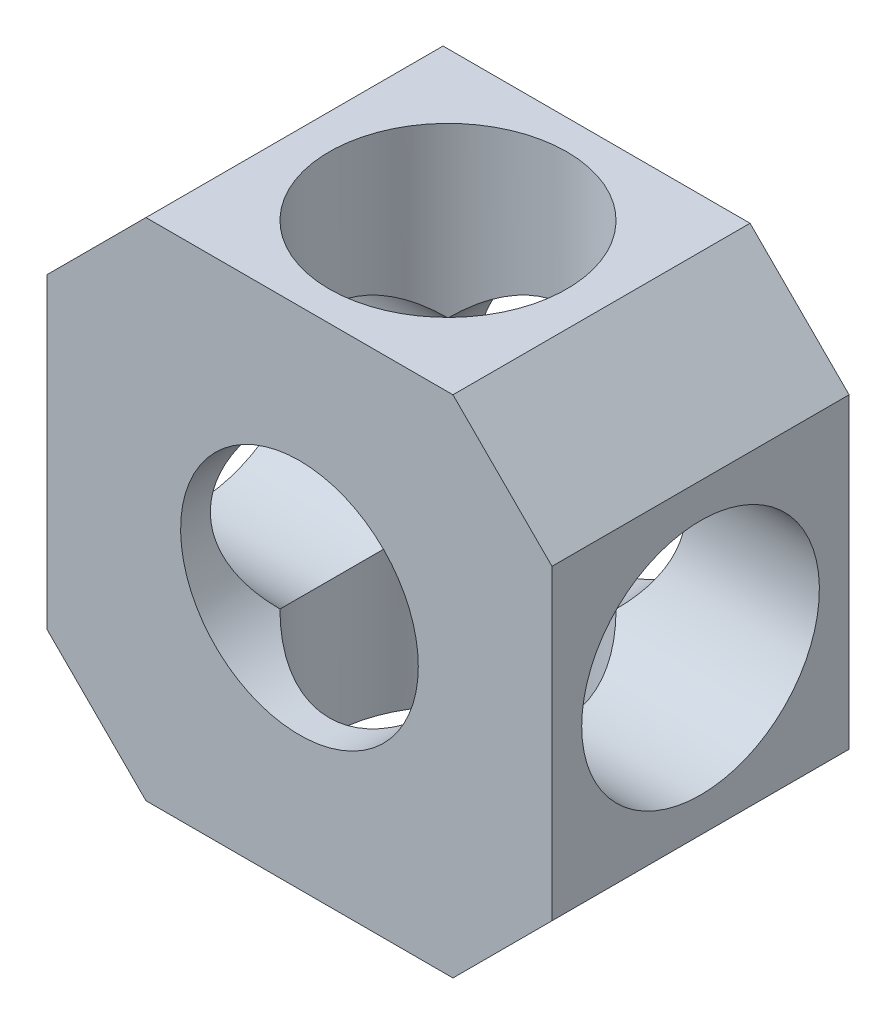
from build123d import *

# Parameters (mm, degrees)
SKETCH1_R           = 6
BOSS_EXTRUDE1_DEPTH = 7.5
SKETCH3_R           = 6
CUT_EXTRUDE1_DEPTH  = 30.479866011
CIRPATTERN1_COUNT   = 4
SCALE1_SCALE        = 0.75


with BuildPart() as part:
    # Sketch1 → Boss-Extrude1 (new, symmetric)
    with BuildSketch(Plane.XY):
        Polygon((-12.75, 7.75), (-7.75, 12.75), (7.75, 12.75), (12.75, 7.75), (12.75, -7.75), (7.75, -12.75), (-7.75, -12.75), (-12.75, -7.75), align=None)
        Circle(SKETCH1_R, mode=Mode.SUBTRACT)
    extrude(amount=BOSS_EXTRUDE1_DEPTH, both=True)

    # Sketch3 → Cut-Extrude1 (cut, through all)
    with BuildSketch(Plane(origin=(0, 12.75, 0), x_dir=(1, 0, 0), z_dir=(0, 1, 0))):
        with Locations(Location((0, 0, 0), (0, 0, 270))):
            Circle(SKETCH3_R)
    cut_extrude1 = extrude(amount=-CUT_EXTRUDE1_DEPTH, mode=Mode.SUBTRACT)

    # CirPattern1: Cut-Extrude1 ×4 about axis
    cirpattern1_axis = Axis((0, 0, 7.5), (0, 0, -1))
    for i in range(1, CIRPATTERN1_COUNT):
        add(cut_extrude1.rotate(cirpattern1_axis, i * 360 / CIRPATTERN1_COUNT), mode=Mode.SUBTRACT)


with BuildPart() as part_1:
    # Scale1: scaled about (0, 0, 0)
    add(part.part.scale(SCALE1_SCALE))


solid = part_1.part
